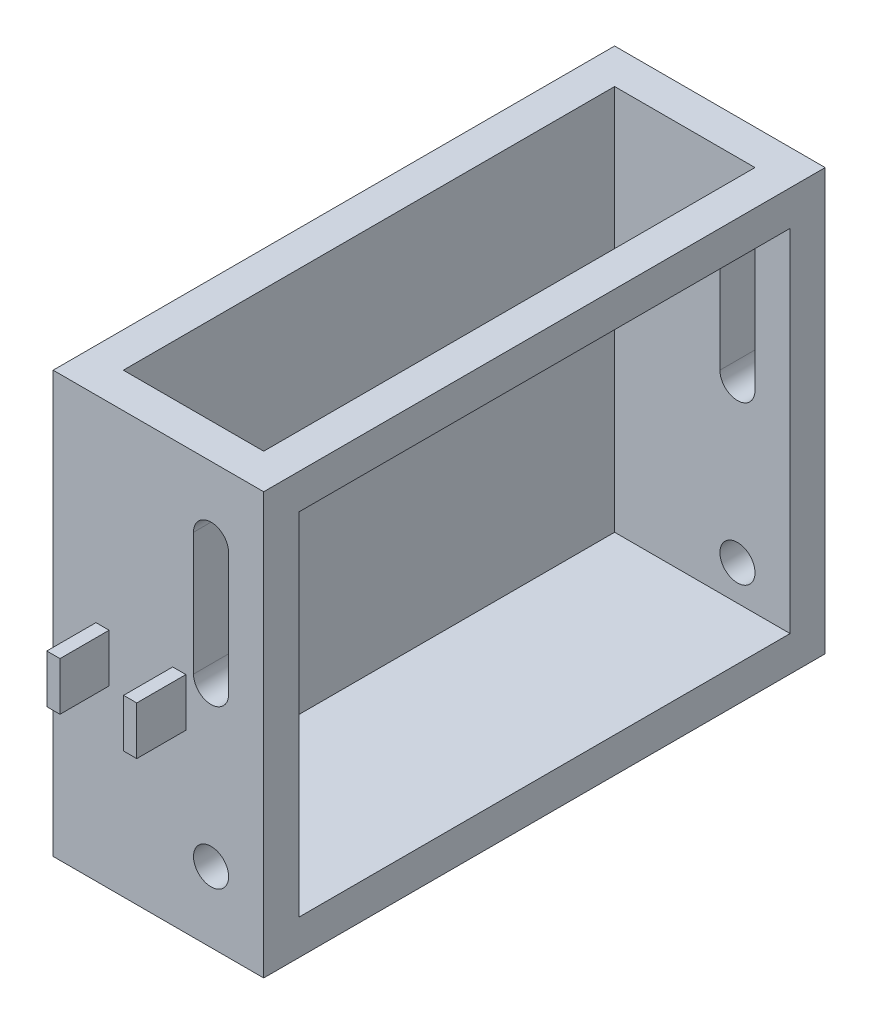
from build123d import *

# Parameters (mm, degrees)
SKETCH1_W           = 76.2
SKETCH1_H           = 203.2
BOSS_EXTRUDE1_DEPTH = 12.7
SKETCH2_W           = 76.2
SKETCH2_H           = 12.7
BOSS_EXTRUDE2_DEPTH = 127
SKETCH3_W           = 76.2
SKETCH3_H           = 203.2
SKETCH3_W_2         = 50.8
SKETCH3_H_2         = 177.8
BOSS_EXTRUDE3_DEPTH = 12.7
SKETCH4_R           = 6.35
CUT_EXTRUDE1_DEPTH  = 266.183785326
SKETCH6_W           = 4.7625
SKETCH6_H           = 17.4625
BOSS_EXTRUDE4_DEPTH = 17.78
SKETCH7_W           = 203.2
SKETCH7_H           = 152.4
BOSS_EXTRUDE5_DEPTH = 12.7


with BuildPart() as part:
    # Sketch1 → Boss-Extrude1 (new body)
    with BuildSketch(Plane(origin=(0, 0, 0), x_dir=(1, 0, 0), z_dir=(0, 1, 0))):
        with Locations((38.1, 101.6)):
            Rectangle(SKETCH1_W, SKETCH1_H)
    extrude(amount=BOSS_EXTRUDE1_DEPTH)

    # Sketch2 → Boss-Extrude2 (add)
    with BuildSketch(Plane(origin=(0, 12.7, 0), x_dir=(1, 0, 0), z_dir=(0, 1, 0))):
        with Locations((38.1, 196.85)):
            Rectangle(SKETCH2_W, SKETCH2_H)
        with Locations((38.1, 6.35)):
            Rectangle(SKETCH2_W, SKETCH2_H)
    extrude(amount=BOSS_EXTRUDE2_DEPTH)

    # Sketch3 → Boss-Extrude3 (add)
    with BuildSketch(Plane(origin=(0, 139.7, 0), x_dir=(1, 0, 0), z_dir=(0, 1, 0))):
        with Locations((38.1, 101.6)):
            Rectangle(SKETCH3_W, SKETCH3_H)
        with Locations((38.1, 101.6)):
            Rectangle(SKETCH3_W_2, SKETCH3_H_2, mode=Mode.SUBTRACT)
    extrude(amount=BOSS_EXTRUDE3_DEPTH)

    # Sketch4 → Cut-Extrude1 (cut, through all)
    with BuildSketch(Plane.XY):
        with Locations((57.15, 25.4)):
            Circle(SKETCH4_R)
        with BuildLine():
            Line((50.8, 127), (50.8, 82.55))
            ThreePointArc((50.8, 82.55), (57.15, 76.2), (63.5, 82.55))
            Line((63.5, 82.55), (63.5, 127))
            ThreePointArc((63.5, 127), (57.15, 133.35), (50.8, 127))
        make_face()
    extrude(amount=-CUT_EXTRUDE1_DEPTH, mode=Mode.SUBTRACT)

    # Sketch6 → Boss-Extrude4 (add)
    with BuildSketch(Plane.XY):
        with Locations((17.87525, 72.29475)):
            Rectangle(SKETCH6_W, SKETCH6_H)
        with Locations((45.6565, 72.29475)):
            Rectangle(SKETCH6_W, SKETCH6_H)
    boss_extrude4 = extrude(amount=BOSS_EXTRUDE4_DEPTH)

    # Mirror1: Boss-Extrude4 across plane
    add(boss_extrude4.mirror(Plane.XY.offset(-101.6)))

    # Sketch7 → Boss-Extrude5 (add)
    with BuildSketch(Plane.ZY):
        with Locations((-101.6, 76.2)):
            Rectangle(SKETCH7_W, SKETCH7_H)
    extrude(amount=-BOSS_EXTRUDE5_DEPTH)


solid = part.part
